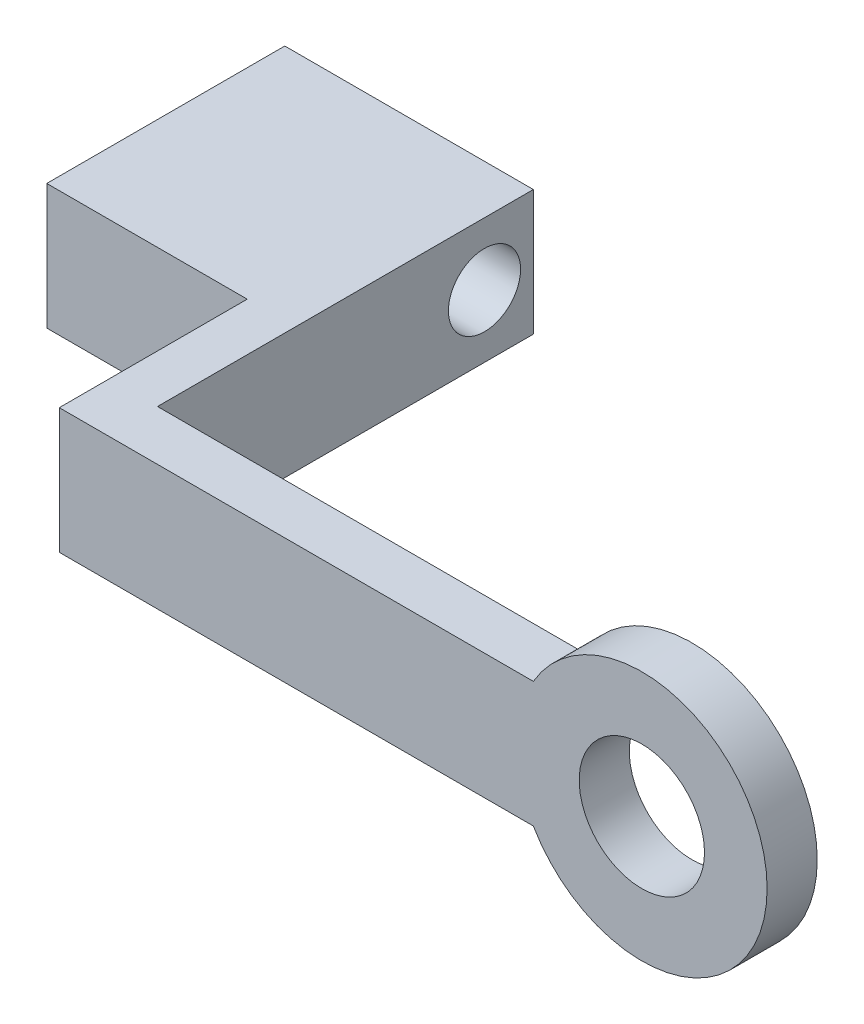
from build123d import *

# Parameters (mm, degrees)
SKETCH1_R           = 3.175
BOSS_EXTRUDE1_DEPTH = 2.54
SKETCH2_W           = 21.59
SKETCH2_H           = 6.35
SKETCH2_R           = 1.8288
BOSS_EXTRUDE2_DEPTH = 24.0284
SKETCH3_W           = 19.05
SKETCH3_H           = 6.35
CUT_EXTRUDE1_DEPTH  = 11.43
SKETCH5_W           = 9.525
SKETCH5_H           = 6.35
CUT_EXTRUDE2_DEPTH  = 10.16


with BuildPart() as part:
    # Sketch1 → Boss-Extrude1 (new body)
    with BuildSketch(Plane.XY):
        with BuildLine():
            Line((-15.659261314, 3.175), (-5.499261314, 3.175))
            ThreePointArc((-5.499261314, 3.175), (6.35, 0), (-5.499261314, -3.175))
            Line((-5.499261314, -3.175), (-15.659261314, -3.175))
            Line((-15.659261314, -3.175), (-15.659261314, 3.175))
        make_face()
        Circle(SKETCH1_R, mode=Mode.SUBTRACT)
    extrude(amount=BOSS_EXTRUDE1_DEPTH)

    # Sketch2 → Boss-Extrude2 (add)
    with BuildSketch(Plane.ZY.offset(15.659261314)):
        with Locations((-8.255, 0)):
            Rectangle(SKETCH2_W, SKETCH2_H)
        with Locations((-16.5735, 0)):
            Circle(SKETCH2_R, mode=Mode.SUBTRACT)
    extrude(amount=BOSS_EXTRUDE2_DEPTH)

    # Sketch3 → Cut-Extrude1 (cut)
    with BuildSketch(Plane(origin=(-15.659261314, 0, 0), x_dir=(0, 0, -1), z_dir=(1, 0, 0))):
        with Locations((9.525, 0)):
            Rectangle(SKETCH3_W, SKETCH3_H)
    extrude(amount=-CUT_EXTRUDE1_DEPTH, mode=Mode.SUBTRACT)

    # Sketch5 → Cut-Extrude2 (cut)
    with BuildSketch(Plane.ZY.offset(39.687661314)):
        with Locations((-2.2225, 0)):
            Rectangle(SKETCH5_W, SKETCH5_H)
    extrude(amount=-CUT_EXTRUDE2_DEPTH, mode=Mode.SUBTRACT)


solid = part.part
